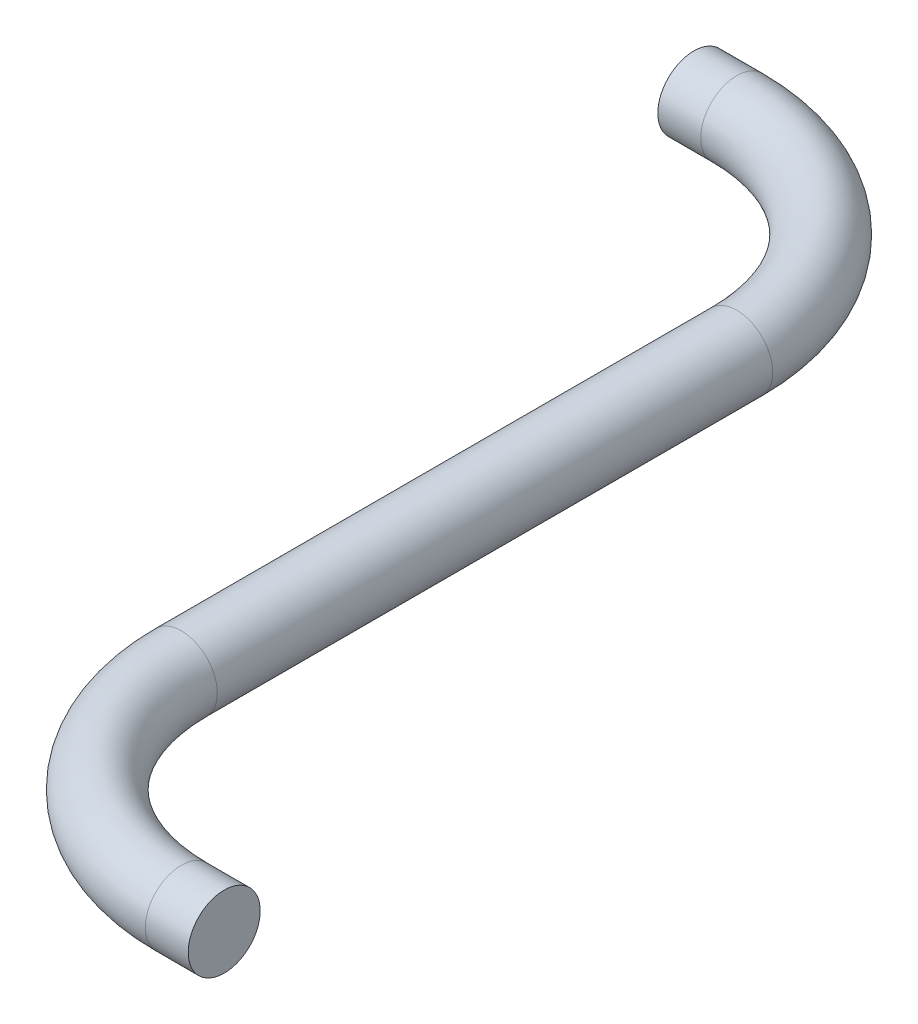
ISO-10303-21;
HEADER;
FILE_DESCRIPTION(('STEP AP214'),'2;1');
FILE_NAME('part.step','',(''),(''),'','','');
FILE_SCHEMA(('AUTOMOTIVE_DESIGN { 1 0 10303 214 1 1 1 1 }'));
ENDSEC;
DATA;
#1=APPLICATION_CONTEXT('core data for automotive mechanical design processes');
#2=APPLICATION_PROTOCOL_DEFINITION('international standard','automotive_design',2000,#1);
#3=PRODUCT_CONTEXT('',#1,'mechanical');
#4=PRODUCT('Part','Part','',(#3));
#5=PRODUCT_RELATED_PRODUCT_CATEGORY('part','',(#4));
#6=PRODUCT_DEFINITION_FORMATION('','',#4);
#7=PRODUCT_DEFINITION_CONTEXT('part definition',#1,'design');
#8=PRODUCT_DEFINITION('design','',#6,#7);
#9=PRODUCT_DEFINITION_SHAPE('','',#8);
#10=(LENGTH_UNIT() NAMED_UNIT(*) SI_UNIT(.MILLI.,.METRE.));
#11=(NAMED_UNIT(*) PLANE_ANGLE_UNIT() SI_UNIT($,.RADIAN.));
#12=(NAMED_UNIT(*) SI_UNIT($,.STERADIAN.) SOLID_ANGLE_UNIT());
#13=UNCERTAINTY_MEASURE_WITH_UNIT(LENGTH_MEASURE(1.E-05),#10,'distance_accuracy_value','');
#14=(GEOMETRIC_REPRESENTATION_CONTEXT(3) GLOBAL_UNCERTAINTY_ASSIGNED_CONTEXT((#13)) GLOBAL_UNIT_ASSIGNED_CONTEXT((#10,
#11,#12)) REPRESENTATION_CONTEXT('',''));
#15=CARTESIAN_POINT('',(0.,0.,0.));
#16=DIRECTION('',(0.,0.,1.));
#17=DIRECTION('',(1.,0.,0.));
#18=AXIS2_PLACEMENT_3D('',#15,#16,#17);
#19=CARTESIAN_POINT('',(19.7996095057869,1.58749999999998,42.3982914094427));
#20=DIRECTION('',(1.,0.,0.));
#21=DIRECTION('',(0.,0.,-1.00000000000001));
#22=AXIS2_PLACEMENT_3D('',#19,#20,#21);
#23=CYLINDRICAL_SURFACE('',#22,1.5875);
#24=CARTESIAN_POINT('',(19.7996095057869,1.58749999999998,42.3982914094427));
#25=DIRECTION('',(1.,0.,0.));
#26=DIRECTION('',(0.,0.,-1.00000000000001));
#27=AXIS2_PLACEMENT_3D('',#24,#25,#26);
#28=CIRCLE('',#27,1.5875);
#29=CARTESIAN_POINT('',(19.7996095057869,1.58749999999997,43.9857914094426));
#30=VERTEX_POINT('',#29);
#31=EDGE_CURVE('E34',#30,#30,#28,.T.);
#32=ORIENTED_EDGE('',*,*,#31,.T.);
#33=EDGE_LOOP('',(#32));
#34=FACE_BOUND('',#33,.T.);
#35=CARTESIAN_POINT('',(21.6916,1.58750000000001,42.3982914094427));
#36=DIRECTION('',(1.,0.,0.));
#37=DIRECTION('',(0.,0.,-1.00000000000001));
#38=AXIS2_PLACEMENT_3D('',#35,#36,#37);
#39=CIRCLE('',#38,1.5875);
#40=CARTESIAN_POINT('',(21.6916,1.58750000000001,40.8107914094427));
#41=VERTEX_POINT('',#40);
#42=EDGE_CURVE('E10',#41,#41,#39,.T.);
#43=ORIENTED_EDGE('',*,*,#42,.F.);
#44=EDGE_LOOP('',(#43));
#45=FACE_BOUND('',#44,.T.);
#46=ADVANCED_FACE('F28',(#34,#45),#23,.T.);
#47=CARTESIAN_POINT('',(19.7996095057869,1.5875,33.4444819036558));
#48=DIRECTION('',(0.,1.00000000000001,0.));
#49=DIRECTION('',(0.,0.,1.00000000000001));
#50=AXIS2_PLACEMENT_3D('',#47,#48,#49);
#51=TOROIDAL_SURFACE('',#50,8.95380950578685,1.5875);
#52=CARTESIAN_POINT('',(10.8458,1.5875,33.4444819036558));
#53=DIRECTION('',(0.,0.,1.00000000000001));
#54=DIRECTION('',(1.,0.,0.));
#55=AXIS2_PLACEMENT_3D('',#52,#53,#54);
#56=CIRCLE('',#55,1.5875);
#57=CARTESIAN_POINT('',(9.2583,1.5875,33.4444819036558));
#58=VERTEX_POINT('',#57);
#59=EDGE_CURVE('E38',#58,#58,#56,.T.);
#60=CARTESIAN_POINT('',(19.7996095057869,1.5875,33.4444819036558));
#61=DIRECTION('',(0.,1.00000000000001,0.));
#62=DIRECTION('',(0.,0.,1.00000000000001));
#63=AXIS2_PLACEMENT_3D('',#60,#61,#62);
#64=CIRCLE('',#63,10.5413095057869);
#65=EDGE_CURVE('',#58,#30,#64,.T.);
#66=ORIENTED_EDGE('',*,*,#59,.T.);
#67=ORIENTED_EDGE('',*,*,#31,.F.);
#68=ORIENTED_EDGE('',*,*,#65,.T.);
#69=ORIENTED_EDGE('',*,*,#65,.F.);
#70=EDGE_LOOP('',(#66,#68,#67,#69));
#71=FACE_BOUND('',#70,.T.);
#72=ADVANCED_FACE('F72',(#71),#51,.T.);
#73=CARTESIAN_POINT('',(10.8458,1.58750000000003,8.95380950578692));
#74=DIRECTION('',(0.,0.,1.00000000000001));
#75=DIRECTION('',(1.,0.,0.));
#76=AXIS2_PLACEMENT_3D('',#73,#74,#75);
#77=CYLINDRICAL_SURFACE('',#76,1.5875);
#78=CARTESIAN_POINT('',(10.8458,1.58750000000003,8.95380950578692));
#79=DIRECTION('',(0.,0.,1.00000000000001));
#80=DIRECTION('',(1.,0.,0.));
#81=AXIS2_PLACEMENT_3D('',#78,#79,#80);
#82=CIRCLE('',#81,1.5875);
#83=CARTESIAN_POINT('',(12.4333000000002,1.58750000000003,8.95380950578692));
#84=VERTEX_POINT('',#83);
#85=EDGE_CURVE('E42',#84,#84,#82,.T.);
#86=ORIENTED_EDGE('',*,*,#85,.T.);
#87=EDGE_LOOP('',(#86));
#88=FACE_BOUND('',#87,.T.);
#89=ORIENTED_EDGE('',*,*,#59,.F.);
#90=EDGE_LOOP('',(#89));
#91=FACE_BOUND('',#90,.T.);
#92=ADVANCED_FACE('F76',(#88,#91),#77,.T.);
#93=CARTESIAN_POINT('',(1.89199049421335,1.58750000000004,8.95380950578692));
#94=DIRECTION('',(0.,-1.00000000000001,0.));
#95=DIRECTION('',(0.,0.,-1.00000000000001));
#96=AXIS2_PLACEMENT_3D('',#93,#94,#95);
#97=TOROIDAL_SURFACE('',#96,8.95380950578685,1.5875);
#98=CARTESIAN_POINT('',(1.89199049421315,1.58749999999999,0.));
#99=DIRECTION('',(1.,0.,0.));
#100=DIRECTION('',(0.,0.,-1.00000000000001));
#101=AXIS2_PLACEMENT_3D('',#98,#99,#100);
#102=CIRCLE('',#101,1.5875);
#103=CARTESIAN_POINT('',(1.89199049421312,1.58749999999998,-1.58749999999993));
#104=VERTEX_POINT('',#103);
#105=EDGE_CURVE('E47',#104,#104,#102,.T.);
#106=CARTESIAN_POINT('',(1.89199049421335,1.58750000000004,8.95380950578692));
#107=DIRECTION('',(0.,-1.00000000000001,0.));
#108=DIRECTION('',(0.,0.,-1.00000000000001));
#109=AXIS2_PLACEMENT_3D('',#106,#107,#108);
#110=CIRCLE('',#109,10.5413095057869);
#111=EDGE_CURVE('',#104,#84,#110,.T.);
#112=ORIENTED_EDGE('',*,*,#105,.T.);
#113=ORIENTED_EDGE('',*,*,#85,.F.);
#114=ORIENTED_EDGE('',*,*,#111,.T.);
#115=ORIENTED_EDGE('',*,*,#111,.F.);
#116=EDGE_LOOP('',(#112,#114,#113,#115));
#117=FACE_BOUND('',#116,.T.);
#118=ADVANCED_FACE('F54',(#117),#97,.T.);
#119=CARTESIAN_POINT('',(1.89199049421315,1.58749999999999,0.));
#120=DIRECTION('',(-1.,0.,0.));
#121=DIRECTION('',(0.,0.,1.00000000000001));
#122=AXIS2_PLACEMENT_3D('',#119,#120,#121);
#123=CYLINDRICAL_SURFACE('',#122,1.5875);
#124=ORIENTED_EDGE('',*,*,#105,.F.);
#125=EDGE_LOOP('',(#124));
#126=FACE_BOUND('',#125,.T.);
#127=CARTESIAN_POINT('',(0.,1.58749999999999,0.));
#128=DIRECTION('',(1.,0.,0.));
#129=DIRECTION('',(0.,0.,-1.00000000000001));
#130=AXIS2_PLACEMENT_3D('',#127,#128,#129);
#131=CIRCLE('',#130,1.5875);
#132=CARTESIAN_POINT('',(0.,1.58749999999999,-1.58750000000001));
#133=VERTEX_POINT('',#132);
#134=EDGE_CURVE('E48',#133,#133,#131,.T.);
#135=ORIENTED_EDGE('',*,*,#134,.T.);
#136=EDGE_LOOP('',(#135));
#137=FACE_BOUND('',#136,.T.);
#138=ADVANCED_FACE('F57',(#126,#137),#123,.T.);
#139=CARTESIAN_POINT('',(21.6916,1.58750000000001,42.3982914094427));
#140=DIRECTION('',(1.,0.,0.));
#141=DIRECTION('',(0.,0.,-1.00000000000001));
#142=AXIS2_PLACEMENT_3D('',#139,#140,#141);
#143=PLANE('',#142);
#144=ORIENTED_EDGE('',*,*,#42,.T.);
#145=EDGE_LOOP('',(#144));
#146=FACE_BOUND('',#145,.T.);
#147=ADVANCED_FACE('F60',(#146),#143,.T.);
#148=CARTESIAN_POINT('',(0.,1.58749999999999,0.));
#149=DIRECTION('',(1.,0.,0.));
#150=DIRECTION('',(0.,0.,-1.00000000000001));
#151=AXIS2_PLACEMENT_3D('',#148,#149,#150);
#152=PLANE('',#151);
#153=ORIENTED_EDGE('',*,*,#134,.F.);
#154=EDGE_LOOP('',(#153));
#155=FACE_BOUND('',#154,.T.);
#156=ADVANCED_FACE('F64',(#155),#152,.F.);
#157=CLOSED_SHELL('',(#46,#72,#92,#118,#138,#147,#156));
#158=MANIFOLD_SOLID_BREP('B2',#157);
#159=ADVANCED_BREP_SHAPE_REPRESENTATION('',(#18,#158),#14);
#160=SHAPE_DEFINITION_REPRESENTATION(#9,#159);
ENDSEC;
END-ISO-10303-21;
